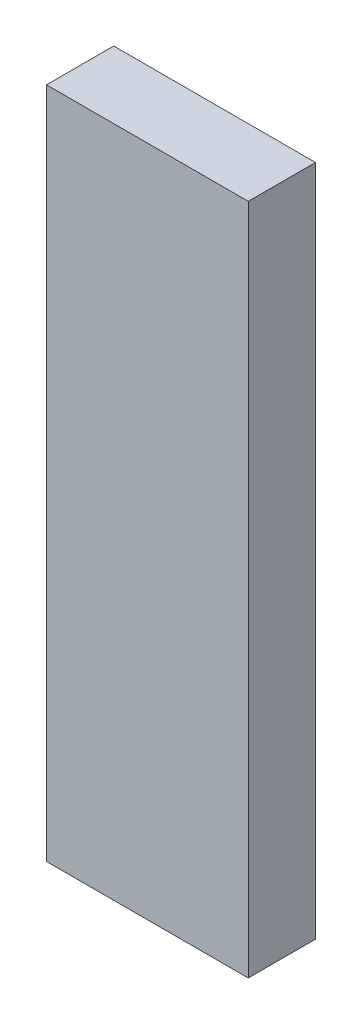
from build123d import *

# Parameters (mm, degrees)
BOSS_EXTRUDE1_DEPTH = 20
SKETCH9_W           = 12.1
SKETCH9_H           = 7.1
CUT_EXTRUDE2_DEPTH  = 33


with BuildPart() as part:
    # Sketch6 → Boss-Extrude1 (new body)
    with BuildSketch(Plane.XY):
        Polygon((15, -100), (30, -100), (30, 100), (-30, 100), (-30, -100), (-15, -100), align=None)
    extrude(amount=BOSS_EXTRUDE1_DEPTH)

    # Sketch9 → Cut-Extrude2 (cut)
    with BuildSketch(Plane.XZ.offset(100)):
        with Locations((0, 10)):
            Rectangle(SKETCH9_W, SKETCH9_H)
    extrude(amount=-CUT_EXTRUDE2_DEPTH, mode=Mode.SUBTRACT)


solid = part.part
